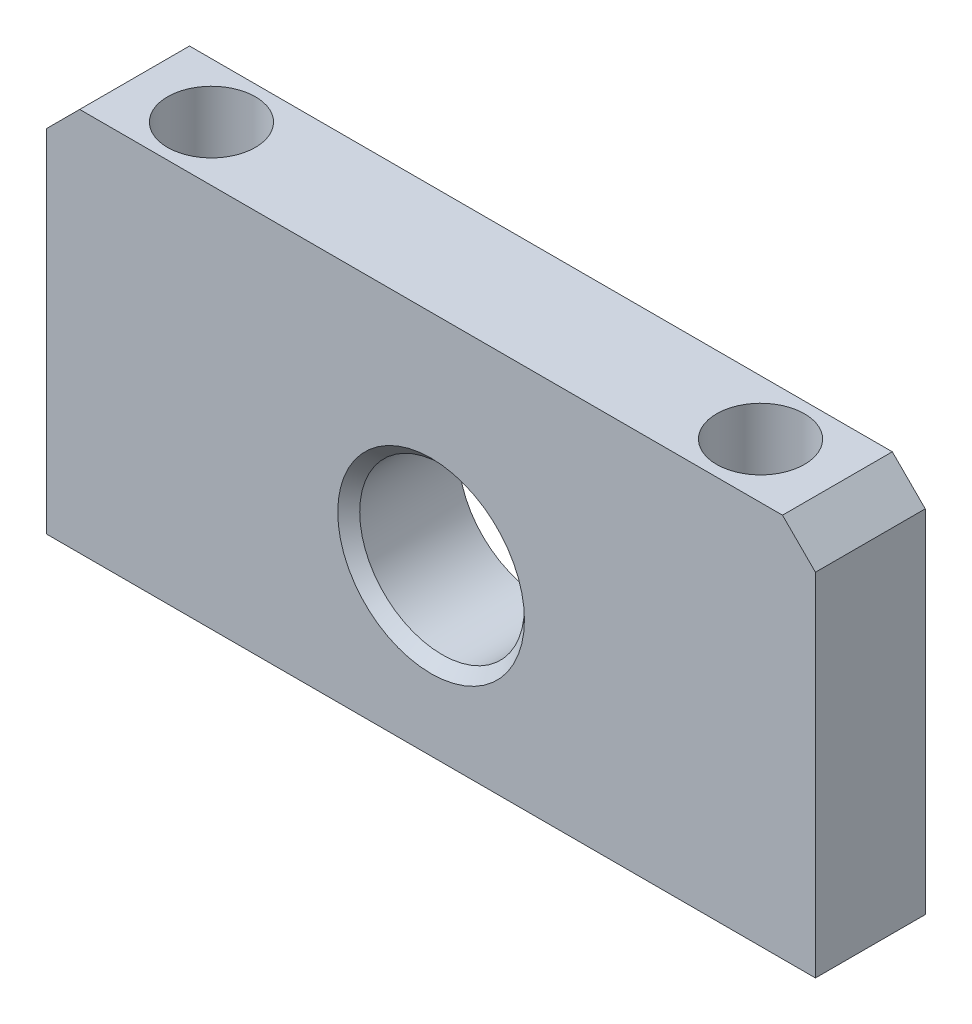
from build123d import *

# Parameters (mm, degrees)
ESQUISSE1_W             = 70
ESQUISSE1_H             = 35
BASE_EXTRUSION_DEPTH    = 10
ESQUISSE2_R             = 4
ENL_V_MAT_EXTRU_1_DEPTH = 10
ESQUISSE3_R             = 2.5
ENL_V_MAT_EXTRU_2_DEPTH = 76
CHANFREIN1_SIZE         = 3
ESQUISSE4_R             = 7.5
ENL_V_MAT_EXTRU_3_DEPTH = 79.89866919
CHANFREIN2_SIZE         = 1


with BuildPart() as part:
    # Esquisse1 → Base-Extrusion (new body)
    with BuildSketch(Plane.XY):
        with Locations((35, 17.5)):
            Rectangle(ESQUISSE1_W, ESQUISSE1_H)
    extrude(amount=BASE_EXTRUSION_DEPTH)

    # Esquisse2 → Enl_v. mat.-Extru.1 (cut)
    with BuildSketch(Plane(origin=(0, 35, 0), x_dir=(-1, 0, 0), z_dir=(0, 1, 0))):
        with Locations(Location((-60, 5, 0), (0, 0, 90))):
            Circle(ESQUISSE2_R)
        with Locations(Location((-10, 5, 0), (0, 0, 90))):
            Circle(ESQUISSE2_R)
    extrude(amount=-ENL_V_MAT_EXTRU_1_DEPTH, mode=Mode.SUBTRACT)

    # Esquisse3 → Enl_v. mat.-Extru.2 (cut, through all)
    with BuildSketch(Plane(origin=(0, 25, 0), x_dir=(-1, 0, 0), z_dir=(0, 1, 0))):
        with Locations(Location((-60, 5, 0), (0, 0, 90))):
            Circle(ESQUISSE3_R)
        with Locations(Location((-10, 5, 0), (0, 0, 90))):
            Circle(ESQUISSE3_R)
    extrude(amount=-ENL_V_MAT_EXTRU_2_DEPTH, mode=Mode.SUBTRACT)

    # Chanfrein1
    chanfrein1_edges = [part.edges().sort_by_distance(p)[0] for p in [
        (0, 35, 5),
        (70, 35, 5),
    ]]
    chamfer(chanfrein1_edges, length=CHANFREIN1_SIZE)

    # Esquisse4 → Enl_v. mat.-Extru.3 (cut, through all)
    with BuildSketch(Plane.XY.offset(10)):
        with Locations((35, 15)):
            Circle(ESQUISSE4_R)
    extrude(amount=-ENL_V_MAT_EXTRU_3_DEPTH, mode=Mode.SUBTRACT)

    # Chanfrein2
    chanfrein2_edges = [part.edges().sort_by_distance(p)[0] for p in [
        (27.5, 15, 10),
    ]]
    chamfer(chanfrein2_edges, length=CHANFREIN2_SIZE)


solid = part.part
